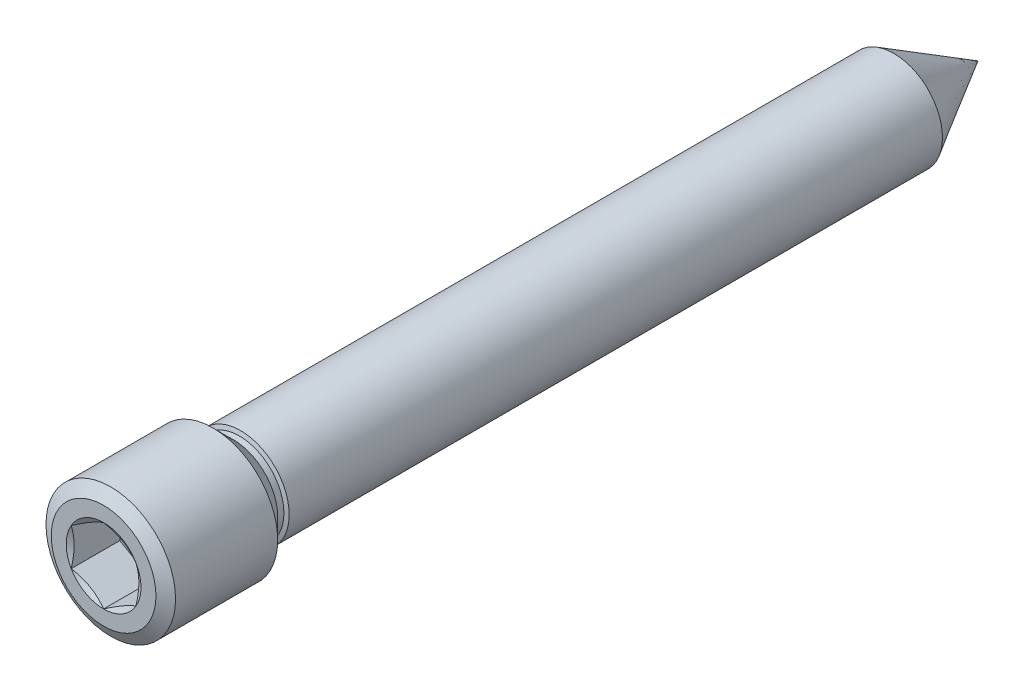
ISO-10303-21;
HEADER;
FILE_DESCRIPTION(('STEP AP214'),'2;1');
FILE_NAME('part.step','',(''),(''),'','','');
FILE_SCHEMA(('AUTOMOTIVE_DESIGN { 1 0 10303 214 1 1 1 1 }'));
ENDSEC;
DATA;
#1=APPLICATION_CONTEXT('core data for automotive mechanical design processes');
#2=APPLICATION_PROTOCOL_DEFINITION('international standard','automotive_design',2000,#1);
#3=PRODUCT_CONTEXT('',#1,'mechanical');
#4=PRODUCT('Part','Part','',(#3));
#5=PRODUCT_RELATED_PRODUCT_CATEGORY('part','',(#4));
#6=PRODUCT_DEFINITION_FORMATION('','',#4);
#7=PRODUCT_DEFINITION_CONTEXT('part definition',#1,'design');
#8=PRODUCT_DEFINITION('design','',#6,#7);
#9=PRODUCT_DEFINITION_SHAPE('','',#8);
#10=(LENGTH_UNIT() NAMED_UNIT(*) SI_UNIT(.MILLI.,.METRE.));
#11=(NAMED_UNIT(*) PLANE_ANGLE_UNIT() SI_UNIT($,.RADIAN.));
#12=(NAMED_UNIT(*) SI_UNIT($,.STERADIAN.) SOLID_ANGLE_UNIT());
#13=UNCERTAINTY_MEASURE_WITH_UNIT(LENGTH_MEASURE(1.E-05),#10,'distance_accuracy_value','');
#14=(GEOMETRIC_REPRESENTATION_CONTEXT(3) GLOBAL_UNCERTAINTY_ASSIGNED_CONTEXT((#13)) GLOBAL_UNIT_ASSIGNED_CONTEXT((#10,
#11,#12)) REPRESENTATION_CONTEXT('',''));
#15=CARTESIAN_POINT('',(0.,0.,0.));
#16=DIRECTION('',(0.,0.,1.));
#17=DIRECTION('',(1.,0.,0.));
#18=AXIS2_PLACEMENT_3D('',#15,#16,#17);
#19=CARTESIAN_POINT('',(0.,0.,-18.));
#20=DIRECTION('',(0.,0.,-1.));
#21=DIRECTION('',(-0.0153873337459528,-0.999881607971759,0.));
#22=AXIS2_PLACEMENT_3D('',#19,#20,#21);
#23=SPHERICAL_SURFACE('',#22,10.);
#24=CARTESIAN_POINT('',(0.,0.,-8.4606079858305));
#25=DIRECTION('',(0.,0.,-1.));
#26=DIRECTION('',(-0.999881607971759,0.0153873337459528,0.));
#27=AXIS2_PLACEMENT_3D('',#24,#25,#26);
#28=CIRCLE('',#27,3.);
#29=CARTESIAN_POINT('',(-0.0461620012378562,-2.99964482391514,-8.4606079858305));
#30=VERTEX_POINT('',#29);
#31=EDGE_CURVE('E205',#30,#30,#28,.T.);
#32=CARTESIAN_POINT('',(0.,0.,-8.38555773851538));
#33=DIRECTION('',(0.,0.,-1.));
#34=DIRECTION('',(-1.,0.,0.));
#35=AXIS2_PLACEMENT_3D('',#32,#33,#34);
#36=CIRCLE('',#35,2.7500000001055);
#37=CARTESIAN_POINT('',(-0.0423151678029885,-2.74967442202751,-8.38555773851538));
#38=VERTEX_POINT('',#37);
#39=EDGE_CURVE('E9',#38,#38,#36,.F.);
#40=CARTESIAN_POINT('',(-0.0461620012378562,-2.99964482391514,-8.4606079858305));
#41=CARTESIAN_POINT('',(-0.0461220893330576,-2.99705131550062,-8.45979226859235));
#42=CARTESIAN_POINT('',(-0.0460821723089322,-2.99445747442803,-8.4589776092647));
#43=CARTESIAN_POINT('',(-0.0460023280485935,-2.98926912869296,-8.45735040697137));
#44=CARTESIAN_POINT('',(-0.0459624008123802,-2.9866746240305,-8.45653786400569));
#45=CARTESIAN_POINT('',(-0.0458825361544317,-2.98148495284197,-8.45491489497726));
#46=CARTESIAN_POINT('',(-0.0458425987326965,-2.97888978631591,-8.45410446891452));
#47=CARTESIAN_POINT('',(-0.0457627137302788,-2.97369879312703,-8.45248573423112));
#48=CARTESIAN_POINT('',(-0.0457227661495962,-2.97110296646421,-8.45167742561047));
#49=CARTESIAN_POINT('',(-0.0456428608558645,-2.96591065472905,-8.45006292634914));
#50=CARTESIAN_POINT('',(-0.0456029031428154,-2.96331416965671,-8.44925673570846));
#51=CARTESIAN_POINT('',(-0.0455229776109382,-2.95812054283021,-8.44764647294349));
#52=CARTESIAN_POINT('',(-0.0454830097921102,-2.95552340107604,-8.44684240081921));
#53=CARTESIAN_POINT('',(-0.0454030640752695,-2.950328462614,-8.44523637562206));
#54=CARTESIAN_POINT('',(-0.045363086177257,-2.94773066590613,-8.4444344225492));
#55=CARTESIAN_POINT('',(-0.0452831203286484,-2.94253441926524,-8.44283263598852));
#56=CARTESIAN_POINT('',(-0.0452431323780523,-2.93993596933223,-8.4420328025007));
#57=CARTESIAN_POINT('',(-0.0451631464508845,-2.93473841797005,-8.4404352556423));
#58=CARTESIAN_POINT('',(-0.0451231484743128,-2.93213931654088,-8.43963754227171));
#59=CARTESIAN_POINT('',(-0.0450431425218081,-2.92694046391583,-8.43804423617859));
#60=CARTESIAN_POINT('',(-0.0450031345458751,-2.92434071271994,-8.43724864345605));
#61=CARTESIAN_POINT('',(-0.0449231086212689,-2.9191405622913,-8.43565957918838));
#62=CARTESIAN_POINT('',(-0.0448830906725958,-2.91654016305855,-8.43486610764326));
#63=CARTESIAN_POINT('',(-0.044803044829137,-2.91133871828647,-8.43328128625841));
#64=CARTESIAN_POINT('',(-0.0447630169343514,-2.90873767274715,-8.43248993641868));
#65=CARTESIAN_POINT('',(-0.044682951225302,-2.90353493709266,-8.43090935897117));
#66=CARTESIAN_POINT('',(-0.0446429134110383,-2.90093324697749,-8.43012013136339));
#67=CARTESIAN_POINT('',(-0.0445628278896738,-2.89572922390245,-8.42854379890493));
#68=CARTESIAN_POINT('',(-0.0445227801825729,-2.89312689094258,-8.42775669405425));
#69=CARTESIAN_POINT('',(-0.0444426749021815,-2.88792158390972,-8.42618460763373));
#70=CARTESIAN_POINT('',(-0.0444026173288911,-2.88531860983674,-8.42539962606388));
#71=CARTESIAN_POINT('',(-0.0443224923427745,-2.88011202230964,-8.42383178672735));
#72=CARTESIAN_POINT('',(-0.0442824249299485,-2.87750840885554,-8.42304892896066));
#73=CARTESIAN_POINT('',(-0.0442022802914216,-2.87230054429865,-8.42148533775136));
#74=CARTESIAN_POINT('',(-0.0441622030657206,-2.86969629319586,-8.42070460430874));
#75=CARTESIAN_POINT('',(-0.0440820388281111,-2.86448715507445,-8.41914526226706));
#76=CARTESIAN_POINT('',(-0.0440419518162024,-2.86188226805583,-8.418366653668));
#77=CARTESIAN_POINT('',(-0.0439617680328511,-2.85667185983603,-8.41681156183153));
#78=CARTESIAN_POINT('',(-0.0439216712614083,-2.85406633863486,-8.41603507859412));
#79=CARTESIAN_POINT('',(-0.0438414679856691,-2.84885466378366,-8.4144842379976));
#80=CARTESIAN_POINT('',(-0.0438013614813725,-2.84624851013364,-8.4137098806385));
#81=CARTESIAN_POINT('',(-0.0437211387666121,-2.84103557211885,-8.41216329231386));
#82=CARTESIAN_POINT('',(-0.0436810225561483,-2.83842878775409,-8.41139106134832));
#83=CARTESIAN_POINT('',(-0.0436007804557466,-2.83321459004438,-8.40984872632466));
#84=CARTESIAN_POINT('',(-0.0435606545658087,-2.83060717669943,-8.40907862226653));
#85=CARTESIAN_POINT('',(-0.0434803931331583,-2.82539172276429,-8.40754054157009));
#86=CARTESIAN_POINT('',(-0.0434402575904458,-2.82278368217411,-8.40677256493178));
#87=CARTESIAN_POINT('',(-0.0433599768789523,-2.81756697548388,-8.405238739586));
#88=CARTESIAN_POINT('',(-0.0433198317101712,-2.81495830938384,-8.40447289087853));
#89=CARTESIAN_POINT('',(-0.0432395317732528,-2.80974035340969,-8.40294332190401));
#90=CARTESIAN_POINT('',(-0.0431993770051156,-2.80713106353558,-8.40217960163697));
#91=CARTESIAN_POINT('',(-0.0431190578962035,-2.8019118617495,-8.40065429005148));
#92=CARTESIAN_POINT('',(-0.0430788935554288,-2.79930194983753,-8.39989269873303));
#93=CARTESIAN_POINT('',(-0.042998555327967,-2.79408150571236,-8.3983716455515));
#94=CARTESIAN_POINT('',(-0.04295838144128,-2.79147097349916,-8.39761218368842));
#95=CARTESIAN_POINT('',(-0.042878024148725,-2.78624929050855,-8.39609538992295));
#96=CARTESIAN_POINT('',(-0.0428378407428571,-2.78363813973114,-8.39533805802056));
#97=CARTESIAN_POINT('',(-0.0427574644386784,-2.77841522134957,-8.39382552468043));
#98=CARTESIAN_POINT('',(-0.0427172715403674,-2.77580345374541,-8.39307032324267));
#99=CARTESIAN_POINT('',(-0.0426368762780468,-2.77057930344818,-8.39156205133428));
#100=CARTESIAN_POINT('',(-0.0425966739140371,-2.76796692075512,-8.39080898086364));
#101=CARTESIAN_POINT('',(-0.042516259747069,-2.76274154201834,-8.38930497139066));
#102=CARTESIAN_POINT('',(-0.0424760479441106,-2.76012854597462,-8.3885540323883));
#103=CARTESIAN_POINT('',(-0.0423956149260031,-2.7549019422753,-8.38705428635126));
#104=CARTESIAN_POINT('',(-0.042355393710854,-2.75228833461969,-8.38630547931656));
#105=CARTESIAN_POINT('',(-0.0423151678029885,-2.74967442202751,-8.38555773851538));
#106=B_SPLINE_CURVE_WITH_KNOTS('',3,(#40,#41,#42,#43,#44,#45,#46,#47,#48,#49,#50,#51,#52,#53,
#54,#55,#56,#57,#58,#59,#60,#61,#62,#63,#64,#65,#66,#67,#68,#69,#70,#71,#72,#73,#74,#75,#76,#77,
#78,#79,#80,#81,#82,#83,#84,#85,#86,#87,#88,#89,#90,#91,#92,#93,#94,#95,#96,#97,#98,#99,#100,
#101,#102,#103,#104,#105),.UNSPECIFIED.,.F.,.F.,(4,2,2,2,2,2,2,2,2,2,2,2,2,2,2,2,2,2,2,2,2,2,2,
2,2,2,2,2,2,2,2,2,4),(0.,0.00815717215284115,0.0163143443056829,0.0244715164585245,
0.0326286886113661,0.04078586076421,0.0489430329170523,0.0571002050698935,0.0652573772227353,
0.0734145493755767,0.0815717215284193,0.089728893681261,0.0978860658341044,0.106043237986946,
0.114200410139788,0.12235758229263,0.130514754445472,0.138671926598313,0.146829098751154,
0.154986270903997,0.163143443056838,0.171300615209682,0.179457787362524,0.187614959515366,
0.195772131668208,0.203929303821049,0.212086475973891,0.220243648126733,0.228400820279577,
0.236557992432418,0.24471516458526,0.252872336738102,0.261029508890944),.UNSPECIFIED.);
#107=EDGE_CURVE('BSEAM14',#30,#38,#106,.T.);
#108=ORIENTED_EDGE('',*,*,#31,.F.);
#109=ORIENTED_EDGE('',*,*,#39,.F.);
#110=ORIENTED_EDGE('',*,*,#107,.T.);
#111=ORIENTED_EDGE('',*,*,#107,.F.);
#112=EDGE_LOOP('',(#108,#110,#109,#111));
#113=FACE_BOUND('',#112,.T.);
#114=ADVANCED_FACE('F14',(#113),#23,.T.);
#115=CARTESIAN_POINT('',(0.,0.,-54.));
#116=DIRECTION('',(0.,0.,1.));
#117=DIRECTION('',(0.999881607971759,-0.0153873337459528,0.));
#118=AXIS2_PLACEMENT_3D('',#115,#116,#117);
#119=CYLINDRICAL_SURFACE('',#118,3.);
#120=ORIENTED_EDGE('',*,*,#31,.T.);
#121=EDGE_LOOP('',(#120));
#122=FACE_BOUND('',#121,.T.);
#123=CARTESIAN_POINT('',(0.,0.,-48.8038475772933));
#124=DIRECTION('',(0.,0.,-1.));
#125=DIRECTION('',(-0.999881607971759,0.0153873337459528,0.));
#126=AXIS2_PLACEMENT_3D('',#123,#124,#125);
#127=CIRCLE('',#126,3.);
#128=CARTESIAN_POINT('',(-2.99964482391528,0.0461620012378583,-48.8038475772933));
#129=VERTEX_POINT('',#128);
#130=EDGE_CURVE('E23',#129,#129,#127,.F.);
#131=ORIENTED_EDGE('',*,*,#130,.T.);
#132=EDGE_LOOP('',(#131));
#133=FACE_BOUND('',#132,.T.);
#134=ADVANCED_FACE('F16',(#122,#133),#119,.T.);
#135=CARTESIAN_POINT('',(0.,0.,-48.8038475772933));
#136=DIRECTION('',(0.,0.,1.));
#137=DIRECTION('',(0.999881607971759,-0.0153873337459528,0.));
#138=AXIS2_PLACEMENT_3D('',#135,#136,#137);
#139=CONICAL_SURFACE('',#138,3.,0.523598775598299);
#140=ORIENTED_EDGE('',*,*,#130,.F.);
#141=EDGE_LOOP('',(#140));
#142=FACE_BOUND('',#141,.T.);
#143=CARTESIAN_POINT('',(0.,0.,-54.));
#144=VERTEX_POINT('',#143);
#145=VERTEX_LOOP('',#144);
#146=FACE_BOUND('',#145,.T.);
#147=ADVANCED_FACE('F232',(#142,#146),#139,.T.);
#148=CARTESIAN_POINT('',(0.,0.,-18.));
#149=DIRECTION('',(0.,0.,1.));
#150=DIRECTION('',(0.,-1.,0.));
#151=AXIS2_PLACEMENT_3D('',#148,#149,#150);
#152=CYLINDRICAL_SURFACE('',#151,2.7500000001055);
#153=CARTESIAN_POINT('',(0.,0.,-7.99999999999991));
#154=DIRECTION('',(0.,0.,-1.));
#155=DIRECTION('',(0.,1.,0.));
#156=AXIS2_PLACEMENT_3D('',#153,#154,#155);
#157=CIRCLE('',#156,2.7500000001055);
#158=CARTESIAN_POINT('',(2.7500000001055,0.,-7.99999999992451));
#159=VERTEX_POINT('',#158);
#160=CARTESIAN_POINT('',(-2.7500000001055,0.,-7.99999999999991));
#161=VERTEX_POINT('',#160);
#162=EDGE_CURVE('E178',#159,#161,#157,.T.);
#163=ORIENTED_EDGE('',*,*,#162,.T.);
#164=CARTESIAN_POINT('',(0.,0.,-7.99999999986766));
#165=DIRECTION('',(0.,0.,1.));
#166=DIRECTION('',(0.,-1.,0.));
#167=AXIS2_PLACEMENT_3D('',#164,#165,#166);
#168=CIRCLE('',#167,2.75000000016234);
#169=EDGE_CURVE('E31',#159,#161,#168,.T.);
#170=ORIENTED_EDGE('',*,*,#169,.F.);
#171=EDGE_LOOP('',(#163,#170));
#172=FACE_BOUND('',#171,.T.);
#173=ORIENTED_EDGE('',*,*,#39,.T.);
#174=EDGE_LOOP('',(#173));
#175=FACE_BOUND('',#174,.T.);
#176=ADVANCED_FACE('F214',(#172,#175),#152,.T.);
#177=CARTESIAN_POINT('',(2.,-1.1547005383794,0.));
#178=DIRECTION('',(1.,0.,0.));
#179=DIRECTION('',(0.,-1.,0.));
#180=AXIS2_PLACEMENT_3D('',#177,#178,#179);
#181=PLANE('',#180);
#182=DIRECTION('',(0.,0.,-1.));
#183=VECTOR('',#182,1.);
#184=CARTESIAN_POINT('',(2.,1.15470053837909,0.));
#185=LINE('',#184,#183);
#186=CARTESIAN_POINT('',(2.00000000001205,1.154700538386,-8.03393809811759E-12));
#187=VERTEX_POINT('',#186);
#188=CARTESIAN_POINT('',(2.,1.15470053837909,-3.));
#189=VERTEX_POINT('',#188);
#190=EDGE_CURVE('E151',#187,#189,#185,.T.);
#191=ORIENTED_EDGE('',*,*,#190,.T.);
#192=DIRECTION('',(0.,1.,0.));
#193=VECTOR('',#192,1.);
#194=CARTESIAN_POINT('',(2.,0.,-3.));
#195=LINE('',#194,#193);
#196=CARTESIAN_POINT('',(2.,-1.1547005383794,-3.));
#197=VERTEX_POINT('',#196);
#198=EDGE_CURVE('E97',#189,#197,#195,.F.);
#199=ORIENTED_EDGE('',*,*,#198,.T.);
#200=DIRECTION('',(0.,0.,-1.));
#201=VECTOR('',#200,1.);
#202=CARTESIAN_POINT('',(2.,-1.1547005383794,0.));
#203=LINE('',#202,#201);
#204=CARTESIAN_POINT('',(2.00000000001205,-1.1547005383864,-8.03393809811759E-12));
#205=VERTEX_POINT('',#204);
#206=EDGE_CURVE('E93',#197,#205,#203,.F.);
#207=ORIENTED_EDGE('',*,*,#206,.T.);
#208=CARTESIAN_POINT('',(2.0000000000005,1.1547005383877,-1.3891990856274E-11));
#209=CARTESIAN_POINT('',(2.00000000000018,1.05991107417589,-0.0273662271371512));
#210=CARTESIAN_POINT('',(2.00000000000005,0.964371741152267,-0.0524207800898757));
#211=CARTESIAN_POINT('',(1.99999999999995,0.771741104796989,-0.0967015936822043));
#212=CARTESIAN_POINT('',(1.99999999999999,0.674646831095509,-0.115914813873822));
#213=CARTESIAN_POINT('',(2.00000000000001,0.481547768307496,-0.146811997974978));
#214=CARTESIAN_POINT('',(2.,0.385570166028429,-0.158660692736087));
#215=CARTESIAN_POINT('',(2.,0.193061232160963,-0.174566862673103));
#216=CARTESIAN_POINT('',(2.,0.0965306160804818,-0.178632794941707));
#217=CARTESIAN_POINT('',(2.,-0.09653061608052,-0.178632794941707));
#218=CARTESIAN_POINT('',(2.,-0.19306123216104,-0.174566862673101));
#219=CARTESIAN_POINT('',(2.,-0.38557016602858,-0.158660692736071));
#220=CARTESIAN_POINT('',(2.,-0.481547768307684,-0.146811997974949));
#221=CARTESIAN_POINT('',(2.,-0.674646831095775,-0.11591481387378));
#222=CARTESIAN_POINT('',(2.,-0.771741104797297,-0.0967015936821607));
#223=CARTESIAN_POINT('',(2.,-0.964371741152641,-0.0524207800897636));
#224=CARTESIAN_POINT('',(2.,-1.05991107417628,-0.0273662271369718));
#225=CARTESIAN_POINT('',(2.,-1.1547005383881,-1.35729101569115E-11));
#226=B_SPLINE_CURVE_WITH_KNOTS('',3,(#208,#209,#210,#211,#212,#213,#214,#215,#216,#217,#218,
#219,#220,#221,#222,#223,#224,#225),.UNSPECIFIED.,.F.,.F.,(4,2,2,2,2,2,2,2,4),(0.,
0.296073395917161,0.592802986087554,0.882630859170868,1.17214361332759,1.46165636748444,
1.75148424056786,2.04821383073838,2.34428722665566),.UNSPECIFIED.);
#227=EDGE_CURVE('E82',#187,#205,#226,.T.);
#228=ORIENTED_EDGE('',*,*,#227,.F.);
#229=EDGE_LOOP('',(#191,#199,#207,#228));
#230=FACE_BOUND('',#229,.T.);
#231=ADVANCED_FACE('F95',(#230),#181,.F.);
#232=CARTESIAN_POINT('',(-2.,1.15470053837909,0.));
#233=DIRECTION('',(-1.,0.,0.));
#234=DIRECTION('',(0.,1.,0.));
#235=AXIS2_PLACEMENT_3D('',#232,#233,#234);
#236=PLANE('',#235);
#237=DIRECTION('',(0.,0.,-1.));
#238=VECTOR('',#237,1.);
#239=CARTESIAN_POINT('',(-2.,-1.1547005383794,0.));
#240=LINE('',#239,#238);
#241=CARTESIAN_POINT('',(-2.0000000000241,-1.1547005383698,-6.79697183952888E-12));
#242=VERTEX_POINT('',#241);
#243=CARTESIAN_POINT('',(-2.,-1.1547005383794,-3.));
#244=VERTEX_POINT('',#243);
#245=EDGE_CURVE('E101',#242,#244,#240,.T.);
#246=ORIENTED_EDGE('',*,*,#245,.T.);
#247=DIRECTION('',(0.,1.,0.));
#248=VECTOR('',#247,1.);
#249=CARTESIAN_POINT('',(-2.,0.,-3.));
#250=LINE('',#249,#248);
#251=CARTESIAN_POINT('',(-2.,1.15470053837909,-3.));
#252=VERTEX_POINT('',#251);
#253=EDGE_CURVE('E154',#244,#252,#250,.T.);
#254=ORIENTED_EDGE('',*,*,#253,.T.);
#255=DIRECTION('',(0.,0.,-1.));
#256=VECTOR('',#255,1.);
#257=CARTESIAN_POINT('',(-2.,1.15470053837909,0.));
#258=LINE('',#257,#256);
#259=CARTESIAN_POINT('',(-2.00000000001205,1.154700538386,-8.03393809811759E-12));
#260=VERTEX_POINT('',#259);
#261=EDGE_CURVE('E142',#252,#260,#258,.F.);
#262=ORIENTED_EDGE('',*,*,#261,.T.);
#263=CARTESIAN_POINT('',(-2.0000000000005,-1.1547005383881,-1.3891990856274E-11));
#264=CARTESIAN_POINT('',(-2.00000000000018,-1.05991107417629,-0.027366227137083));
#265=CARTESIAN_POINT('',(-2.00000000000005,-0.964371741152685,-0.0524207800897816));
#266=CARTESIAN_POINT('',(-1.99999999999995,-0.771741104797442,-0.0967015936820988));
#267=CARTESIAN_POINT('',(-1.99999999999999,-0.674646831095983,-0.115914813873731));
#268=CARTESIAN_POINT('',(-2.00000000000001,-0.48154776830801,-0.14681199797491));
#269=CARTESIAN_POINT('',(-2.,-0.385570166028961,-0.158660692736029));
#270=CARTESIAN_POINT('',(-2.,-0.193061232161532,-0.17456686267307));
#271=CARTESIAN_POINT('',(-2.,-0.0965306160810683,-0.178632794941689));
#272=CARTESIAN_POINT('',(-2.,0.0965306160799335,-0.178632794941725));
#273=CARTESIAN_POINT('',(-2.,0.193061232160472,-0.174566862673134));
#274=CARTESIAN_POINT('',(-2.,0.385570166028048,-0.158660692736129));
#275=CARTESIAN_POINT('',(-2.,0.48154776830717,-0.146811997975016));
#276=CARTESIAN_POINT('',(-2.,0.674646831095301,-0.115914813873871));
#277=CARTESIAN_POINT('',(-2.,0.771741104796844,-0.0967015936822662));
#278=CARTESIAN_POINT('',(-2.,0.964371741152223,-0.0524207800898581));
#279=CARTESIAN_POINT('',(-2.,1.05991107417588,-0.0273662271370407));
#280=CARTESIAN_POINT('',(-2.,1.1547005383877,-1.35738859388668E-11));
#281=B_SPLINE_CURVE_WITH_KNOTS('',3,(#263,#264,#265,#266,#267,#268,#269,#270,#271,#272,#273,
#274,#275,#276,#277,#278,#279,#280),.UNSPECIFIED.,.F.,.F.,(4,2,2,2,2,2,2,2,4),(0.,
0.296073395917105,0.592802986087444,0.882630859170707,1.17214361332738,1.46165636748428,
1.75148424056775,2.04821383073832,2.34428722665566),.UNSPECIFIED.);
#282=EDGE_CURVE('E90',#242,#260,#281,.T.);
#283=ORIENTED_EDGE('',*,*,#282,.F.);
#284=EDGE_LOOP('',(#246,#254,#262,#283));
#285=FACE_BOUND('',#284,.T.);
#286=ADVANCED_FACE('F264',(#285),#236,.F.);
#287=CARTESIAN_POINT('',(0.,0.,-3.));
#288=DIRECTION('',(0.,0.,-1.));
#289=DIRECTION('',(0.,1.,0.));
#290=AXIS2_PLACEMENT_3D('',#287,#288,#289);
#291=PLANE('',#290);
#292=ORIENTED_EDGE('',*,*,#198,.F.);
#293=DIRECTION('',(0.866025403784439,-0.5,0.));
#294=VECTOR('',#293,1.);
#295=CARTESIAN_POINT('',(2.,1.15470053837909,-3.));
#296=LINE('',#295,#294);
#297=CARTESIAN_POINT('',(0.,2.3094010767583,-3.));
#298=VERTEX_POINT('',#297);
#299=EDGE_CURVE('E139',#189,#298,#296,.F.);
#300=ORIENTED_EDGE('',*,*,#299,.T.);
#301=DIRECTION('',(0.866025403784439,0.5,0.));
#302=VECTOR('',#301,1.);
#303=CARTESIAN_POINT('',(0.,2.3094010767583,-3.));
#304=LINE('',#303,#302);
#305=EDGE_CURVE('E141',#298,#252,#304,.F.);
#306=ORIENTED_EDGE('',*,*,#305,.T.);
#307=ORIENTED_EDGE('',*,*,#253,.F.);
#308=DIRECTION('',(-0.866025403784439,0.5,0.));
#309=VECTOR('',#308,1.);
#310=CARTESIAN_POINT('',(-2.,-1.1547005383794,-3.));
#311=LINE('',#310,#309);
#312=CARTESIAN_POINT('',(0.,-2.30940107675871,-3.));
#313=VERTEX_POINT('',#312);
#314=EDGE_CURVE('E147',#244,#313,#311,.F.);
#315=ORIENTED_EDGE('',*,*,#314,.T.);
#316=DIRECTION('',(-0.866025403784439,-0.5,0.));
#317=VECTOR('',#316,1.);
#318=CARTESIAN_POINT('',(0.,-2.30940107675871,-3.));
#319=LINE('',#318,#317);
#320=EDGE_CURVE('E159',#313,#197,#319,.F.);
#321=ORIENTED_EDGE('',*,*,#320,.T.);
#322=EDGE_LOOP('',(#292,#300,#306,#307,#315,#321));
#323=FACE_BOUND('',#322,.T.);
#324=ADVANCED_FACE('F270',(#323),#291,.F.);
#325=CARTESIAN_POINT('',(0.,2.3094010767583,0.));
#326=DIRECTION('',(-0.5,0.866025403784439,0.));
#327=DIRECTION('',(0.866025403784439,0.5,0.));
#328=AXIS2_PLACEMENT_3D('',#325,#326,#327);
#329=PLANE('',#328);
#330=ORIENTED_EDGE('',*,*,#261,.F.);
#331=ORIENTED_EDGE('',*,*,#305,.F.);
#332=DIRECTION('',(0.,0.,-1.));
#333=VECTOR('',#332,1.);
#334=CARTESIAN_POINT('',(0.,2.3094010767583,0.));
#335=LINE('',#334,#333);
#336=CARTESIAN_POINT('',(0.,2.3094010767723,-8.03393809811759E-12));
#337=VERTEX_POINT('',#336);
#338=EDGE_CURVE('E163',#298,#337,#335,.F.);
#339=ORIENTED_EDGE('',*,*,#338,.T.);
#340=CARTESIAN_POINT('',(8.65280069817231E-12,2.3094010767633,-1.31869341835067E-11));
#341=CARTESIAN_POINT('',(-0.0878878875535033,2.25865898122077,-0.0293044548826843));
#342=CARTESIAN_POINT('',(-0.176534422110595,2.20747888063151,-0.055955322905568));
#343=CARTESIAN_POINT('',(-0.355362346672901,2.10423253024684,-0.102473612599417));
#344=CARTESIAN_POINT('',(-0.445546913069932,2.05216444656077,-0.122324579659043));
#345=CARTESIAN_POINT('',(-0.624798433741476,1.94867353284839,-0.153224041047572));
#346=CARTESIAN_POINT('',(-0.713837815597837,1.89726662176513,-0.16447821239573));
#347=CARTESIAN_POINT('',(-0.892335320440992,1.7942110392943,-0.17791083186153));
#348=CARTESIAN_POINT('',(-0.981792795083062,1.74256274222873,-0.180100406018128));
#349=CARTESIAN_POINT('',(-1.14893448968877,1.64606343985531,-0.175533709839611));
#350=CARTESIAN_POINT('',(-1.22664379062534,1.60119795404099,-0.169898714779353));
#351=CARTESIAN_POINT('',(-1.38155614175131,1.51175926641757,-0.152042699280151));
#352=CARTESIAN_POINT('',(-1.45875865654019,1.46718637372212,-0.139815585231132));
#353=CARTESIAN_POINT('',(-1.61399014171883,1.37756343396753,-0.109250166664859));
#354=CARTESIAN_POINT('',(-1.69199947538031,1.33252472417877,-0.0907823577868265));
#355=CARTESIAN_POINT('',(-1.84685497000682,1.24311886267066,-0.0488682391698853));
#356=CARTESIAN_POINT('',(-1.92370311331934,1.19875056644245,-0.0254317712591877));
#357=CARTESIAN_POINT('',(-2.0000000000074,1.1547005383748,-1.35989310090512E-11));
#358=B_SPLINE_CURVE_WITH_KNOTS('',3,(#340,#341,#342,#343,#344,#345,#346,#347,#348,#349,#350,
#351,#352,#353,#354,#355,#356,#357),.UNSPECIFIED.,.F.,.F.,(4,2,2,2,2,2,2,2,4),(0.,
0.317016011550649,0.634793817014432,0.944707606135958,1.25424088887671,1.52370778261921,
1.7934241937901,2.0691216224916,2.34427797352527),.UNSPECIFIED.);
#359=EDGE_CURVE('E200',#337,#260,#358,.T.);
#360=ORIENTED_EDGE('',*,*,#359,.T.);
#361=EDGE_LOOP('',(#330,#331,#339,#360));
#362=FACE_BOUND('',#361,.T.);
#363=ADVANCED_FACE('F278',(#362),#329,.F.);
#364=CARTESIAN_POINT('',(2.,1.15470053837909,0.));
#365=DIRECTION('',(0.5,0.866025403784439,0.));
#366=DIRECTION('',(0.866025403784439,-0.5,0.));
#367=AXIS2_PLACEMENT_3D('',#364,#365,#366);
#368=PLANE('',#367);
#369=ORIENTED_EDGE('',*,*,#338,.F.);
#370=ORIENTED_EDGE('',*,*,#299,.F.);
#371=ORIENTED_EDGE('',*,*,#190,.F.);
#372=CARTESIAN_POINT('',(2.00000000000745,1.1547005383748,-1.35979552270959E-11));
#373=CARTESIAN_POINT('',(1.9121121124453,1.20544263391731,-0.0293044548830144));
#374=CARTESIAN_POINT('',(1.82346557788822,1.25662273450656,-0.0559553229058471));
#375=CARTESIAN_POINT('',(1.64463765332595,1.35986908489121,-0.102473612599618));
#376=CARTESIAN_POINT('',(1.55445308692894,1.41193716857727,-0.122324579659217));
#377=CARTESIAN_POINT('',(1.37520156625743,1.51542808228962,-0.15322404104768));
#378=CARTESIAN_POINT('',(1.28616218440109,1.56683499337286,-0.1644782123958));
#379=CARTESIAN_POINT('',(1.10766467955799,1.6698905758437,-0.177910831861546));
#380=CARTESIAN_POINT('',(1.01820720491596,1.72153887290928,-0.180100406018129));
#381=CARTESIAN_POINT('',(0.851065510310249,1.8180381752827,-0.175533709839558));
#382=CARTESIAN_POINT('',(0.773356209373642,1.862903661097,-0.169898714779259));
#383=CARTESIAN_POINT('',(0.618443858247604,1.95234234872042,-0.152042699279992));
#384=CARTESIAN_POINT('',(0.541241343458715,1.9969152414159,-0.139815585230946));
#385=CARTESIAN_POINT('',(0.386009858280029,2.08653818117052,-0.10925016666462));
#386=CARTESIAN_POINT('',(0.308000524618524,2.1315768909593,-0.0907823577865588));
#387=CARTESIAN_POINT('',(0.153145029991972,2.22098275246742,-0.048868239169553));
#388=CARTESIAN_POINT('',(0.0762968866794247,2.26535104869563,-0.0254317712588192));
#389=CARTESIAN_POINT('',(-8.64933125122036E-12,2.3094010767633,-1.31869341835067E-11));
#390=B_SPLINE_CURVE_WITH_KNOTS('',3,(#372,#373,#374,#375,#376,#377,#378,#379,#380,#381,#382,
#383,#384,#385,#386,#387,#388,#389),.UNSPECIFIED.,.F.,.F.,(4,2,2,2,2,2,2,2,4),(0.,
0.317016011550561,0.63479381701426,0.944707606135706,1.25424088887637,1.52370778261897,
1.79342419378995,2.06912162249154,2.3442779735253),.UNSPECIFIED.);
#391=EDGE_CURVE('E191',#187,#337,#390,.T.);
#392=ORIENTED_EDGE('',*,*,#391,.T.);
#393=EDGE_LOOP('',(#369,#370,#371,#392));
#394=FACE_BOUND('',#393,.T.);
#395=ADVANCED_FACE('F286',(#394),#368,.F.);
#396=CARTESIAN_POINT('',(0.,-2.30940107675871,0.));
#397=DIRECTION('',(0.5,-0.866025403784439,0.));
#398=DIRECTION('',(-0.866025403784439,-0.5,0.));
#399=AXIS2_PLACEMENT_3D('',#396,#397,#398);
#400=PLANE('',#399);
#401=ORIENTED_EDGE('',*,*,#206,.F.);
#402=ORIENTED_EDGE('',*,*,#320,.F.);
#403=DIRECTION('',(0.,0.,-1.));
#404=VECTOR('',#403,1.);
#405=CARTESIAN_POINT('',(0.,-2.30940107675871,0.));
#406=LINE('',#405,#404);
#407=CARTESIAN_POINT('',(0.,-2.3094010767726,-8.03393809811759E-12));
#408=VERTEX_POINT('',#407);
#409=EDGE_CURVE('E108',#313,#408,#406,.F.);
#410=ORIENTED_EDGE('',*,*,#409,.T.);
#411=CARTESIAN_POINT('',(-8.64933125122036E-12,-2.3094010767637,-1.31869341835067E-11));
#412=CARTESIAN_POINT('',(0.0878878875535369,-2.25865898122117,-0.0293044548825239));
#413=CARTESIAN_POINT('',(0.176534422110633,-2.2074788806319,-0.0559553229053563));
#414=CARTESIAN_POINT('',(0.355362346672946,-2.10423253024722,-0.102473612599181));
#415=CARTESIAN_POINT('',(0.445546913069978,-2.05216444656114,-0.122324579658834));
#416=CARTESIAN_POINT('',(0.624798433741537,-1.94867353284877,-0.153224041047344));
#417=CARTESIAN_POINT('',(0.713837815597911,-1.89726662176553,-0.164478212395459));
#418=CARTESIAN_POINT('',(0.89233532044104,-1.79421103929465,-0.177910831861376));
#419=CARTESIAN_POINT('',(0.98179279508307,-1.74256274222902,-0.180100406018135));
#420=CARTESIAN_POINT('',(1.14893448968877,-1.64606343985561,-0.175533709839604));
#421=CARTESIAN_POINT('',(1.22664379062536,-1.60119795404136,-0.169898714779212));
#422=CARTESIAN_POINT('',(1.38155614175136,-1.51175926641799,-0.152042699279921));
#423=CARTESIAN_POINT('',(1.45875865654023,-1.46718637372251,-0.139815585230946));
#424=CARTESIAN_POINT('',(1.61399014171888,-1.37756343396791,-0.109250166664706));
#425=CARTESIAN_POINT('',(1.69199947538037,-1.33252472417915,-0.0907823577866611));
#426=CARTESIAN_POINT('',(1.84685497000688,-1.24311886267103,-0.0488682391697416));
#427=CARTESIAN_POINT('',(1.9237031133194,-1.19875056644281,-0.0254317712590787));
#428=CARTESIAN_POINT('',(2.00000000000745,-1.1547005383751,-1.35979552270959E-11));
#429=B_SPLINE_CURVE_WITH_KNOTS('',3,(#411,#412,#413,#414,#415,#416,#417,#418,#419,#420,#421,
#422,#423,#424,#425,#426,#427,#428),.UNSPECIFIED.,.F.,.F.,(4,2,2,2,2,2,2,2,4),(0.,
0.317016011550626,0.634793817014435,0.944707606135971,1.25424088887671,1.52370778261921,
1.7934241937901,2.06912162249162,2.34427797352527),.UNSPECIFIED.);
#430=EDGE_CURVE('E104',#408,#205,#429,.T.);
#431=ORIENTED_EDGE('',*,*,#430,.T.);
#432=EDGE_LOOP('',(#401,#402,#410,#431));
#433=FACE_BOUND('',#432,.T.);
#434=ADVANCED_FACE('F106',(#433),#400,.F.);
#435=CARTESIAN_POINT('',(-2.,-1.1547005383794,0.));
#436=DIRECTION('',(-0.5,-0.866025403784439,0.));
#437=DIRECTION('',(-0.866025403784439,0.5,0.));
#438=AXIS2_PLACEMENT_3D('',#435,#436,#437);
#439=PLANE('',#438);
#440=ORIENTED_EDGE('',*,*,#409,.F.);
#441=ORIENTED_EDGE('',*,*,#314,.F.);
#442=ORIENTED_EDGE('',*,*,#245,.F.);
#443=CARTESIAN_POINT('',(-2.0000000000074,-1.1547005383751,-1.35979552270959E-11));
#444=CARTESIAN_POINT('',(-1.91211211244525,-1.20544263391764,-0.0293044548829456));
#445=CARTESIAN_POINT('',(-1.82346557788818,-1.2566227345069,-0.055955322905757));
#446=CARTESIAN_POINT('',(-1.64463765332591,-1.35986908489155,-0.102473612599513));
#447=CARTESIAN_POINT('',(-1.55445308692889,-1.41193716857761,-0.122324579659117));
#448=CARTESIAN_POINT('',(-1.37520156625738,-1.51542808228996,-0.153224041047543));
#449=CARTESIAN_POINT('',(-1.28616218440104,-1.56683499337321,-0.16447821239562));
#450=CARTESIAN_POINT('',(-1.10766467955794,-1.66989057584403,-0.177910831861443));
#451=CARTESIAN_POINT('',(-1.0182072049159,-1.72153887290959,-0.180100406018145));
#452=CARTESIAN_POINT('',(-0.851065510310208,-1.81803817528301,-0.175533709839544));
#453=CARTESIAN_POINT('',(-0.77335620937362,-1.86290366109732,-0.169898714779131));
#454=CARTESIAN_POINT('',(-0.618443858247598,-1.95234234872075,-0.152042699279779));
#455=CARTESIAN_POINT('',(-0.541241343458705,-1.99691524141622,-0.139815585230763));
#456=CARTESIAN_POINT('',(-0.386009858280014,-2.08653818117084,-0.109250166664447));
#457=CARTESIAN_POINT('',(-0.308000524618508,-2.13157689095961,-0.0907823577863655));
#458=CARTESIAN_POINT('',(-0.15314502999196,-2.22098275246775,-0.0488682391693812));
#459=CARTESIAN_POINT('',(-0.0762968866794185,-2.26535104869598,-0.02543177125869));
#460=CARTESIAN_POINT('',(8.65280069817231E-12,-2.3094010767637,-1.31869341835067E-11));
#461=B_SPLINE_CURVE_WITH_KNOTS('',3,(#443,#444,#445,#446,#447,#448,#449,#450,#451,#452,#453,
#454,#455,#456,#457,#458,#459,#460),.UNSPECIFIED.,.F.,.F.,(4,2,2,2,2,2,2,2,4),(0.,
0.317016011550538,0.634793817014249,0.944707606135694,1.25424088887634,1.52370778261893,
1.7934241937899,2.06912162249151,2.34427797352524),.UNSPECIFIED.);
#462=EDGE_CURVE('E112',#242,#408,#461,.T.);
#463=ORIENTED_EDGE('',*,*,#462,.T.);
#464=EDGE_LOOP('',(#440,#441,#442,#463));
#465=FACE_BOUND('',#464,.T.);
#466=ADVANCED_FACE('F301',(#465),#439,.F.);
#467=CARTESIAN_POINT('',(0.,0.,0.));
#468=DIRECTION('',(0.,0.,1.));
#469=DIRECTION('',(-1.,0.,0.));
#470=AXIS2_PLACEMENT_3D('',#467,#468,#469);
#471=CONICAL_SURFACE('',#470,2.30940107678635,1.04719755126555);
#472=ORIENTED_EDGE('',*,*,#282,.T.);
#473=CARTESIAN_POINT('',(0.,0.,0.));
#474=DIRECTION('',(0.,0.,1.));
#475=DIRECTION('',(-1.,0.,0.));
#476=AXIS2_PLACEMENT_3D('',#473,#474,#475);
#477=CIRCLE('',#476,2.30940107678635);
#478=EDGE_CURVE('E135',#242,#260,#477,.F.);
#479=ORIENTED_EDGE('',*,*,#478,.F.);
#480=EDGE_LOOP('',(#472,#479));
#481=FACE_BOUND('',#480,.T.);
#482=ADVANCED_FACE('F308',(#481),#471,.F.);
#483=CARTESIAN_POINT('',(0.,0.,0.));
#484=DIRECTION('',(0.,0.,1.));
#485=DIRECTION('',(-1.,0.,0.));
#486=AXIS2_PLACEMENT_3D('',#483,#484,#485);
#487=CONICAL_SURFACE('',#486,2.30940107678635,1.04719755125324);
#488=CARTESIAN_POINT('',(0.,0.,0.));
#489=DIRECTION('',(0.,0.,1.));
#490=DIRECTION('',(-1.,0.,0.));
#491=AXIS2_PLACEMENT_3D('',#488,#489,#490);
#492=CIRCLE('',#491,2.30940107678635);
#493=EDGE_CURVE('E131',#260,#337,#492,.F.);
#494=ORIENTED_EDGE('',*,*,#493,.F.);
#495=ORIENTED_EDGE('',*,*,#359,.F.);
#496=EDGE_LOOP('',(#494,#495));
#497=FACE_BOUND('',#496,.T.);
#498=ADVANCED_FACE('F316',(#497),#487,.F.);
#499=CARTESIAN_POINT('',(0.,0.,0.));
#500=DIRECTION('',(0.,0.,1.));
#501=DIRECTION('',(-1.,0.,0.));
#502=AXIS2_PLACEMENT_3D('',#499,#500,#501);
#503=CONICAL_SURFACE('',#502,2.30940107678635,1.04719755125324);
#504=CARTESIAN_POINT('',(0.,0.,0.));
#505=DIRECTION('',(0.,0.,1.));
#506=DIRECTION('',(-1.,0.,0.));
#507=AXIS2_PLACEMENT_3D('',#504,#505,#506);
#508=CIRCLE('',#507,2.30940107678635);
#509=EDGE_CURVE('E125',#337,#187,#508,.F.);
#510=ORIENTED_EDGE('',*,*,#509,.F.);
#511=ORIENTED_EDGE('',*,*,#391,.F.);
#512=EDGE_LOOP('',(#510,#511));
#513=FACE_BOUND('',#512,.T.);
#514=ADVANCED_FACE('F324',(#513),#503,.F.);
#515=CARTESIAN_POINT('',(0.,0.,0.));
#516=DIRECTION('',(0.,0.,1.));
#517=DIRECTION('',(-1.,0.,0.));
#518=AXIS2_PLACEMENT_3D('',#515,#516,#517);
#519=CONICAL_SURFACE('',#518,2.30940107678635,1.04719755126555);
#520=ORIENTED_EDGE('',*,*,#227,.T.);
#521=CARTESIAN_POINT('',(0.,0.,0.));
#522=DIRECTION('',(0.,0.,1.));
#523=DIRECTION('',(-1.,0.,0.));
#524=AXIS2_PLACEMENT_3D('',#521,#522,#523);
#525=CIRCLE('',#524,2.30940107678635);
#526=EDGE_CURVE('E86',#187,#205,#525,.F.);
#527=ORIENTED_EDGE('',*,*,#526,.F.);
#528=EDGE_LOOP('',(#520,#527));
#529=FACE_BOUND('',#528,.T.);
#530=ADVANCED_FACE('F84',(#529),#519,.F.);
#531=CARTESIAN_POINT('',(0.,0.,0.));
#532=DIRECTION('',(0.,0.,1.));
#533=DIRECTION('',(-1.,0.,0.));
#534=AXIS2_PLACEMENT_3D('',#531,#532,#533);
#535=CONICAL_SURFACE('',#534,2.30940107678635,1.04719755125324);
#536=CARTESIAN_POINT('',(0.,0.,0.));
#537=DIRECTION('',(0.,0.,1.));
#538=DIRECTION('',(-1.,0.,0.));
#539=AXIS2_PLACEMENT_3D('',#536,#537,#538);
#540=CIRCLE('',#539,2.30940107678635);
#541=EDGE_CURVE('E89',#205,#408,#540,.F.);
#542=ORIENTED_EDGE('',*,*,#541,.F.);
#543=ORIENTED_EDGE('',*,*,#430,.F.);
#544=EDGE_LOOP('',(#542,#543));
#545=FACE_BOUND('',#544,.T.);
#546=ADVANCED_FACE('F115',(#545),#535,.F.);
#547=CARTESIAN_POINT('',(0.,0.,0.));
#548=DIRECTION('',(0.,0.,1.));
#549=DIRECTION('',(-1.,0.,0.));
#550=AXIS2_PLACEMENT_3D('',#547,#548,#549);
#551=CONICAL_SURFACE('',#550,2.30940107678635,1.04719755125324);
#552=CARTESIAN_POINT('',(0.,0.,0.));
#553=DIRECTION('',(0.,0.,1.));
#554=DIRECTION('',(-1.,0.,0.));
#555=AXIS2_PLACEMENT_3D('',#552,#553,#554);
#556=CIRCLE('',#555,2.30940107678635);
#557=EDGE_CURVE('E118',#408,#242,#556,.F.);
#558=ORIENTED_EDGE('',*,*,#557,.F.);
#559=ORIENTED_EDGE('',*,*,#462,.F.);
#560=EDGE_LOOP('',(#558,#559));
#561=FACE_BOUND('',#560,.T.);
#562=ADVANCED_FACE('F345',(#561),#551,.F.);
#563=CARTESIAN_POINT('',(-2.77120053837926,0.,0.));
#564=DIRECTION('',(0.,0.,1.));
#565=DIRECTION('',(-1.,0.,0.));
#566=AXIS2_PLACEMENT_3D('',#563,#564,#565);
#567=PLANE('',#566);
#568=ORIENTED_EDGE('',*,*,#541,.T.);
#569=ORIENTED_EDGE('',*,*,#557,.T.);
#570=ORIENTED_EDGE('',*,*,#478,.T.);
#571=ORIENTED_EDGE('',*,*,#493,.T.);
#572=ORIENTED_EDGE('',*,*,#509,.T.);
#573=ORIENTED_EDGE('',*,*,#526,.T.);
#574=EDGE_LOOP('',(#568,#569,#570,#571,#572,#573));
#575=FACE_BOUND('',#574,.T.);
#576=CARTESIAN_POINT('',(0.,0.,2.40280885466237E-11));
#577=DIRECTION('',(0.,0.,-1.));
#578=DIRECTION('',(1.,0.,0.));
#579=AXIS2_PLACEMENT_3D('',#576,#577,#578);
#580=CIRCLE('',#579,3.23299999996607);
#581=CARTESIAN_POINT('',(3.23299999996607,0.,2.40280905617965E-11));
#582=VERTEX_POINT('',#581);
#583=EDGE_CURVE('E126',#582,#582,#580,.T.);
#584=ORIENTED_EDGE('',*,*,#583,.F.);
#585=EDGE_LOOP('',(#584));
#586=FACE_BOUND('',#585,.T.);
#587=ADVANCED_FACE('F121',(#575,#586),#567,.T.);
#588=CARTESIAN_POINT('',(0.,0.,-6.75000000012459));
#589=DIRECTION('',(0.,0.,1.));
#590=DIRECTION('',(-1.,0.,0.));
#591=AXIS2_PLACEMENT_3D('',#588,#589,#590);
#592=CONICAL_SURFACE('',#591,3.99999999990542,0.785398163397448);
#593=DIRECTION('',(-0.707106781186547,0.,-0.707106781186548));
#594=VECTOR('',#593,1.);
#595=CARTESIAN_POINT('',(499000.,-2.96998536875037E-10,498989.25));
#596=LINE('',#595,#594);
#597=CARTESIAN_POINT('',(3.99999999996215,0.,-6.75000000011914));
#598=VERTEX_POINT('',#597);
#599=EDGE_CURVE('E129',#598,#159,#596,.T.);
#600=ORIENTED_EDGE('',*,*,#599,.F.);
#601=CARTESIAN_POINT('',(0.,0.,-6.75));
#602=DIRECTION('',(0.,0.,1.));
#603=DIRECTION('',(-1.,0.,0.));
#604=AXIS2_PLACEMENT_3D('',#601,#602,#603);
#605=CIRCLE('',#604,4.);
#606=CARTESIAN_POINT('',(-3.99999999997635,0.,-6.75000000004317));
#607=VERTEX_POINT('',#606);
#608=EDGE_CURVE('E173',#607,#598,#605,.T.);
#609=ORIENTED_EDGE('',*,*,#608,.F.);
#610=DIRECTION('',(0.707106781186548,0.,-0.707106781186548));
#611=VECTOR('',#610,1.);
#612=CARTESIAN_POINT('',(-499000.,1.57297785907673E-10,498989.25));
#613=LINE('',#612,#611);
#614=EDGE_CURVE('E168',#161,#607,#613,.F.);
#615=ORIENTED_EDGE('',*,*,#614,.F.);
#616=ORIENTED_EDGE('',*,*,#162,.F.);
#617=EDGE_LOOP('',(#600,#609,#615,#616));
#618=FACE_BOUND('',#617,.T.);
#619=ADVANCED_FACE('F217',(#618),#592,.T.);
#620=CARTESIAN_POINT('',(0.,0.,-0.442827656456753));
#621=DIRECTION('',(0.,0.,-1.));
#622=DIRECTION('',(1.,0.,0.));
#623=AXIS2_PLACEMENT_3D('',#620,#621,#622);
#624=CONICAL_SURFACE('',#623,3.99999999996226,1.04719755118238);
#625=ORIENTED_EDGE('',*,*,#583,.T.);
#626=EDGE_LOOP('',(#625));
#627=FACE_BOUND('',#626,.T.);
#628=CARTESIAN_POINT('',(0.,0.,-0.442827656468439));
#629=DIRECTION('',(0.,0.,1.));
#630=DIRECTION('',(-1.,0.,0.));
#631=AXIS2_PLACEMENT_3D('',#628,#629,#630);
#632=CIRCLE('',#631,4.);
#633=CARTESIAN_POINT('',(-4.,0.,-0.442827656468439));
#634=VERTEX_POINT('',#633);
#635=EDGE_CURVE('E164',#634,#634,#632,.F.);
#636=ORIENTED_EDGE('',*,*,#635,.F.);
#637=EDGE_LOOP('',(#636));
#638=FACE_BOUND('',#637,.T.);
#639=ADVANCED_FACE('F229',(#627,#638),#624,.T.);
#640=CARTESIAN_POINT('',(0.,0.,-6.75000000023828));
#641=DIRECTION('',(0.,0.,1.));
#642=DIRECTION('',(0.,-1.,0.));
#643=AXIS2_PLACEMENT_3D('',#640,#641,#642);
#644=CONICAL_SURFACE('',#643,3.99999999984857,0.785398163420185);
#645=ORIENTED_EDGE('',*,*,#599,.T.);
#646=ORIENTED_EDGE('',*,*,#169,.T.);
#647=ORIENTED_EDGE('',*,*,#614,.T.);
#648=CARTESIAN_POINT('',(0.,0.,-6.75));
#649=DIRECTION('',(0.,0.,1.));
#650=DIRECTION('',(-1.,0.,0.));
#651=AXIS2_PLACEMENT_3D('',#648,#649,#650);
#652=CIRCLE('',#651,4.);
#653=EDGE_CURVE('E167',#598,#607,#652,.T.);
#654=ORIENTED_EDGE('',*,*,#653,.F.);
#655=EDGE_LOOP('',(#645,#646,#647,#654));
#656=FACE_BOUND('',#655,.T.);
#657=ADVANCED_FACE('F219',(#656),#644,.T.);
#658=CARTESIAN_POINT('',(0.,0.,-3.59641382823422));
#659=DIRECTION('',(0.,0.,1.));
#660=DIRECTION('',(-1.,0.,0.));
#661=AXIS2_PLACEMENT_3D('',#658,#659,#660);
#662=CYLINDRICAL_SURFACE('',#661,4.);
#663=ORIENTED_EDGE('',*,*,#635,.T.);
#664=EDGE_LOOP('',(#663));
#665=FACE_BOUND('',#664,.T.);
#666=ORIENTED_EDGE('',*,*,#653,.T.);
#667=ORIENTED_EDGE('',*,*,#608,.T.);
#668=EDGE_LOOP('',(#666,#667));
#669=FACE_BOUND('',#668,.T.);
#670=ADVANCED_FACE('F221',(#665,#669),#662,.T.);
#671=CLOSED_SHELL('',(#114,#134,#147,#176,#231,#286,#324,#363,#395,#434,#466,#482,#498,#514,
#530,#546,#562,#587,#619,#639,#657,#670));
#672=MANIFOLD_SOLID_BREP('B1',#671);
#673=ADVANCED_BREP_SHAPE_REPRESENTATION('',(#18,#672),#14);
#674=SHAPE_DEFINITION_REPRESENTATION(#9,#673);
ENDSEC;
END-ISO-10303-21;
